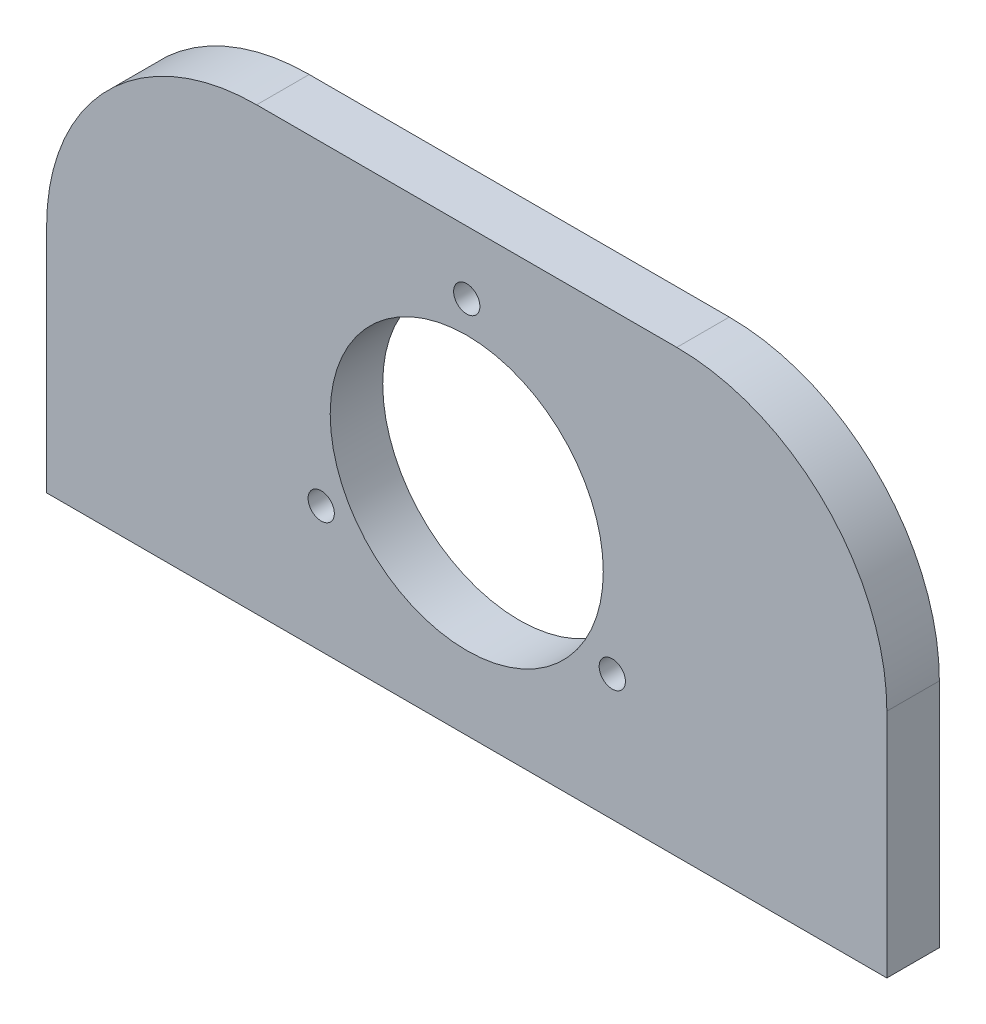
ISO-10303-21;
HEADER;
FILE_DESCRIPTION(('STEP AP214'),'2;1');
FILE_NAME('part.step','',(''),(''),'','','');
FILE_SCHEMA(('AUTOMOTIVE_DESIGN { 1 0 10303 214 1 1 1 1 }'));
ENDSEC;
DATA;
#1=APPLICATION_CONTEXT('core data for automotive mechanical design processes');
#2=APPLICATION_PROTOCOL_DEFINITION('international standard','automotive_design',2000,#1);
#3=PRODUCT_CONTEXT('',#1,'mechanical');
#4=PRODUCT('Part','Part','',(#3));
#5=PRODUCT_RELATED_PRODUCT_CATEGORY('part','',(#4));
#6=PRODUCT_DEFINITION_FORMATION('','',#4);
#7=PRODUCT_DEFINITION_CONTEXT('part definition',#1,'design');
#8=PRODUCT_DEFINITION('design','',#6,#7);
#9=PRODUCT_DEFINITION_SHAPE('','',#8);
#10=(LENGTH_UNIT() NAMED_UNIT(*) SI_UNIT(.MILLI.,.METRE.));
#11=(NAMED_UNIT(*) PLANE_ANGLE_UNIT() SI_UNIT($,.RADIAN.));
#12=(NAMED_UNIT(*) SI_UNIT($,.STERADIAN.) SOLID_ANGLE_UNIT());
#13=UNCERTAINTY_MEASURE_WITH_UNIT(LENGTH_MEASURE(1.E-05),#10,'distance_accuracy_value','');
#14=(GEOMETRIC_REPRESENTATION_CONTEXT(3) GLOBAL_UNCERTAINTY_ASSIGNED_CONTEXT((#13)) GLOBAL_UNIT_ASSIGNED_CONTEXT((#10,
#11,#12)) REPRESENTATION_CONTEXT('',''));
#15=CARTESIAN_POINT('',(0.,0.,0.));
#16=DIRECTION('',(0.,0.,1.));
#17=DIRECTION('',(1.,0.,0.));
#18=AXIS2_PLACEMENT_3D('',#15,#16,#17);
#19=CARTESIAN_POINT('',(0.,0.,2.5));
#20=DIRECTION('',(0.,0.,1.));
#21=DIRECTION('',(1.,0.,0.));
#22=AXIS2_PLACEMENT_3D('',#19,#20,#21);
#23=PLANE('',#22);
#24=CARTESIAN_POINT('',(13.856406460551,-7.99999999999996,2.5));
#25=DIRECTION('',(0.,0.,1.));
#26=DIRECTION('',(1.,0.,0.));
#27=AXIS2_PLACEMENT_3D('',#24,#25,#26);
#28=CIRCLE('',#27,1.25);
#29=CARTESIAN_POINT('',(15.106406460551,-7.99999999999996,2.5));
#30=VERTEX_POINT('',#29);
#31=EDGE_CURVE('E404',#30,#30,#28,.T.);
#32=ORIENTED_EDGE('',*,*,#31,.F.);
#33=EDGE_LOOP('',(#32));
#34=FACE_BOUND('',#33,.T.);
#35=CARTESIAN_POINT('',(0.,16.,2.5));
#36=DIRECTION('',(0.,0.,1.));
#37=DIRECTION('',(1.,0.,0.));
#38=AXIS2_PLACEMENT_3D('',#35,#36,#37);
#39=CIRCLE('',#38,1.25);
#40=CARTESIAN_POINT('',(1.25,16.,2.5));
#41=VERTEX_POINT('',#40);
#42=EDGE_CURVE('E406',#41,#41,#39,.T.);
#43=ORIENTED_EDGE('',*,*,#42,.F.);
#44=EDGE_LOOP('',(#43));
#45=FACE_BOUND('',#44,.T.);
#46=CARTESIAN_POINT('',(-13.856406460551,-7.99999999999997,2.5));
#47=DIRECTION('',(0.,0.,1.));
#48=DIRECTION('',(1.,0.,0.));
#49=AXIS2_PLACEMENT_3D('',#46,#47,#48);
#50=CIRCLE('',#49,1.25);
#51=CARTESIAN_POINT('',(-12.606406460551,-7.99999999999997,2.5));
#52=VERTEX_POINT('',#51);
#53=EDGE_CURVE('E414',#52,#52,#50,.T.);
#54=ORIENTED_EDGE('',*,*,#53,.F.);
#55=EDGE_LOOP('',(#54));
#56=FACE_BOUND('',#55,.T.);
#57=DIRECTION('',(0.,1.,0.));
#58=VECTOR('',#57,1.);
#59=CARTESIAN_POINT('',(40.,22.,2.5));
#60=LINE('',#59,#58);
#61=CARTESIAN_POINT('',(40.,-20.,2.5));
#62=VERTEX_POINT('',#61);
#63=CARTESIAN_POINT('',(40.,2.00000000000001,2.5));
#64=VERTEX_POINT('',#63);
#65=EDGE_CURVE('E152',#62,#64,#60,.T.);
#66=ORIENTED_EDGE('',*,*,#65,.T.);
#67=CARTESIAN_POINT('',(20.,2.00000000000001,2.5));
#68=DIRECTION('',(0.,0.,1.));
#69=DIRECTION('',(1.,0.,0.));
#70=AXIS2_PLACEMENT_3D('',#67,#68,#69);
#71=CIRCLE('',#70,20.);
#72=CARTESIAN_POINT('',(20.,22.,2.5));
#73=VERTEX_POINT('',#72);
#74=EDGE_CURVE('E47',#64,#73,#71,.T.);
#75=ORIENTED_EDGE('',*,*,#74,.T.);
#76=DIRECTION('',(-1.,0.,0.));
#77=VECTOR('',#76,1.);
#78=CARTESIAN_POINT('',(-40.,22.,2.5));
#79=LINE('',#78,#77);
#80=CARTESIAN_POINT('',(-20.,22.,2.5));
#81=VERTEX_POINT('',#80);
#82=EDGE_CURVE('E154',#73,#81,#79,.T.);
#83=ORIENTED_EDGE('',*,*,#82,.T.);
#84=CARTESIAN_POINT('',(-20.,2.,2.5));
#85=DIRECTION('',(0.,0.,1.));
#86=DIRECTION('',(1.,0.,0.));
#87=AXIS2_PLACEMENT_3D('',#84,#85,#86);
#88=CIRCLE('',#87,20.);
#89=CARTESIAN_POINT('',(-40.,1.99999999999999,2.5));
#90=VERTEX_POINT('',#89);
#91=EDGE_CURVE('E54',#81,#90,#88,.T.);
#92=ORIENTED_EDGE('',*,*,#91,.T.);
#93=DIRECTION('',(0.,-1.,0.));
#94=VECTOR('',#93,1.);
#95=CARTESIAN_POINT('',(-40.,22.,2.5));
#96=LINE('',#95,#94);
#97=CARTESIAN_POINT('',(-40.,-20.,2.5));
#98=VERTEX_POINT('',#97);
#99=EDGE_CURVE('E147',#90,#98,#96,.T.);
#100=ORIENTED_EDGE('',*,*,#99,.T.);
#101=DIRECTION('',(1.,0.,0.));
#102=VECTOR('',#101,1.);
#103=CARTESIAN_POINT('',(-40.,-20.,2.5));
#104=LINE('',#103,#102);
#105=EDGE_CURVE('E149',#98,#62,#104,.T.);
#106=ORIENTED_EDGE('',*,*,#105,.T.);
#107=EDGE_LOOP('',(#66,#75,#83,#92,#100,#106));
#108=FACE_BOUND('',#107,.T.);
#109=CARTESIAN_POINT('',(0.,0.,2.5));
#110=DIRECTION('',(0.,0.,1.));
#111=DIRECTION('',(1.,0.,0.));
#112=AXIS2_PLACEMENT_3D('',#109,#110,#111);
#113=CIRCLE('',#112,13.);
#114=CARTESIAN_POINT('',(13.,0.,2.5));
#115=VERTEX_POINT('',#114);
#116=EDGE_CURVE('E141',#115,#115,#113,.T.);
#117=ORIENTED_EDGE('',*,*,#116,.F.);
#118=EDGE_LOOP('',(#117));
#119=FACE_BOUND('',#118,.T.);
#120=ADVANCED_FACE('F39',(#34,#45,#56,#108,#119),#23,.T.);
#121=CARTESIAN_POINT('',(0.,0.,-2.5));
#122=DIRECTION('',(0.,0.,1.));
#123=DIRECTION('',(1.,0.,0.));
#124=AXIS2_PLACEMENT_3D('',#121,#122,#123);
#125=PLANE('',#124);
#126=CARTESIAN_POINT('',(13.856406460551,-7.99999999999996,-2.5));
#127=DIRECTION('',(0.,0.,1.));
#128=DIRECTION('',(1.,0.,0.));
#129=AXIS2_PLACEMENT_3D('',#126,#127,#128);
#130=CIRCLE('',#129,1.25);
#131=CARTESIAN_POINT('',(15.106406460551,-7.99999999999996,-2.5));
#132=VERTEX_POINT('',#131);
#133=EDGE_CURVE('E402',#132,#132,#130,.T.);
#134=ORIENTED_EDGE('',*,*,#133,.T.);
#135=EDGE_LOOP('',(#134));
#136=FACE_BOUND('',#135,.T.);
#137=CARTESIAN_POINT('',(0.,16.,-2.5));
#138=DIRECTION('',(0.,0.,1.));
#139=DIRECTION('',(1.,0.,0.));
#140=AXIS2_PLACEMENT_3D('',#137,#138,#139);
#141=CIRCLE('',#140,1.25);
#142=CARTESIAN_POINT('',(1.25,16.,-2.5));
#143=VERTEX_POINT('',#142);
#144=EDGE_CURVE('E411',#143,#143,#141,.T.);
#145=ORIENTED_EDGE('',*,*,#144,.T.);
#146=EDGE_LOOP('',(#145));
#147=FACE_BOUND('',#146,.T.);
#148=CARTESIAN_POINT('',(-13.856406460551,-7.99999999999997,-2.5));
#149=DIRECTION('',(0.,0.,1.));
#150=DIRECTION('',(1.,0.,0.));
#151=AXIS2_PLACEMENT_3D('',#148,#149,#150);
#152=CIRCLE('',#151,1.25);
#153=CARTESIAN_POINT('',(-12.606406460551,-7.99999999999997,-2.5));
#154=VERTEX_POINT('',#153);
#155=EDGE_CURVE('E122',#154,#154,#152,.T.);
#156=ORIENTED_EDGE('',*,*,#155,.T.);
#157=EDGE_LOOP('',(#156));
#158=FACE_BOUND('',#157,.T.);
#159=DIRECTION('',(-1.,0.,0.));
#160=VECTOR('',#159,1.);
#161=CARTESIAN_POINT('',(-40.,22.,-2.5));
#162=LINE('',#161,#160);
#163=CARTESIAN_POINT('',(20.,22.,-2.5));
#164=VERTEX_POINT('',#163);
#165=CARTESIAN_POINT('',(-20.,22.,-2.5));
#166=VERTEX_POINT('',#165);
#167=EDGE_CURVE('E150',#164,#166,#162,.T.);
#168=ORIENTED_EDGE('',*,*,#167,.F.);
#169=CARTESIAN_POINT('',(20.,2.00000000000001,-2.5));
#170=DIRECTION('',(0.,0.,1.));
#171=DIRECTION('',(1.,0.,0.));
#172=AXIS2_PLACEMENT_3D('',#169,#170,#171);
#173=CIRCLE('',#172,20.);
#174=CARTESIAN_POINT('',(40.,2.00000000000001,-2.5));
#175=VERTEX_POINT('',#174);
#176=EDGE_CURVE('E176',#164,#175,#173,.F.);
#177=ORIENTED_EDGE('',*,*,#176,.T.);
#178=DIRECTION('',(0.,1.,0.));
#179=VECTOR('',#178,1.);
#180=CARTESIAN_POINT('',(40.,22.,-2.5));
#181=LINE('',#180,#179);
#182=CARTESIAN_POINT('',(40.,-20.,-2.5));
#183=VERTEX_POINT('',#182);
#184=EDGE_CURVE('E160',#183,#175,#181,.T.);
#185=ORIENTED_EDGE('',*,*,#184,.F.);
#186=DIRECTION('',(1.,0.,0.));
#187=VECTOR('',#186,1.);
#188=CARTESIAN_POINT('',(-40.,-20.,-2.5));
#189=LINE('',#188,#187);
#190=CARTESIAN_POINT('',(-40.,-20.,-2.5));
#191=VERTEX_POINT('',#190);
#192=EDGE_CURVE('E158',#191,#183,#189,.T.);
#193=ORIENTED_EDGE('',*,*,#192,.F.);
#194=DIRECTION('',(0.,-1.,0.));
#195=VECTOR('',#194,1.);
#196=CARTESIAN_POINT('',(-40.,22.,-2.5));
#197=LINE('',#196,#195);
#198=CARTESIAN_POINT('',(-40.,1.99999999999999,-2.5));
#199=VERTEX_POINT('',#198);
#200=EDGE_CURVE('E144',#199,#191,#197,.T.);
#201=ORIENTED_EDGE('',*,*,#200,.F.);
#202=CARTESIAN_POINT('',(-20.,2.,-2.5));
#203=DIRECTION('',(0.,0.,1.));
#204=DIRECTION('',(1.,0.,0.));
#205=AXIS2_PLACEMENT_3D('',#202,#203,#204);
#206=CIRCLE('',#205,20.);
#207=EDGE_CURVE('E174',#199,#166,#206,.F.);
#208=ORIENTED_EDGE('',*,*,#207,.T.);
#209=EDGE_LOOP('',(#168,#177,#185,#193,#201,#208));
#210=FACE_BOUND('',#209,.T.);
#211=CARTESIAN_POINT('',(0.,0.,-2.5));
#212=DIRECTION('',(0.,0.,1.));
#213=DIRECTION('',(1.,0.,0.));
#214=AXIS2_PLACEMENT_3D('',#211,#212,#213);
#215=CIRCLE('',#214,13.);
#216=CARTESIAN_POINT('',(13.,0.,-2.5));
#217=VERTEX_POINT('',#216);
#218=EDGE_CURVE('E140',#217,#217,#215,.T.);
#219=ORIENTED_EDGE('',*,*,#218,.T.);
#220=EDGE_LOOP('',(#219));
#221=FACE_BOUND('',#220,.T.);
#222=ADVANCED_FACE('F191',(#136,#147,#158,#210,#221),#125,.F.);
#223=CARTESIAN_POINT('',(-40.,22.,2.5));
#224=DIRECTION('',(1.,0.,0.));
#225=DIRECTION('',(0.,1.,0.));
#226=AXIS2_PLACEMENT_3D('',#223,#224,#225);
#227=PLANE('',#226);
#228=ORIENTED_EDGE('',*,*,#99,.F.);
#229=DIRECTION('',(0.,0.,-1.));
#230=VECTOR('',#229,1.);
#231=CARTESIAN_POINT('',(-40.,1.99999999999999,2.5));
#232=LINE('',#231,#230);
#233=EDGE_CURVE('E11',#90,#199,#232,.T.);
#234=ORIENTED_EDGE('',*,*,#233,.T.);
#235=ORIENTED_EDGE('',*,*,#200,.T.);
#236=DIRECTION('',(0.,0.,-1.));
#237=VECTOR('',#236,1.);
#238=CARTESIAN_POINT('',(-40.,-20.,2.5));
#239=LINE('',#238,#237);
#240=EDGE_CURVE('E166',#98,#191,#239,.T.);
#241=ORIENTED_EDGE('',*,*,#240,.F.);
#242=EDGE_LOOP('',(#228,#234,#235,#241));
#243=FACE_BOUND('',#242,.T.);
#244=ADVANCED_FACE('F202',(#243),#227,.F.);
#245=CARTESIAN_POINT('',(-40.,-20.,2.5));
#246=DIRECTION('',(0.,1.,0.));
#247=DIRECTION('',(-1.,0.,0.));
#248=AXIS2_PLACEMENT_3D('',#245,#246,#247);
#249=PLANE('',#248);
#250=CARTESIAN_POINT('',(33.5,-20.,0.));
#251=DIRECTION('',(0.,-1.,0.));
#252=DIRECTION('',(0.,0.,-1.));
#253=AXIS2_PLACEMENT_3D('',#250,#251,#252);
#254=CIRCLE('',#253,1.64999999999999);
#255=CARTESIAN_POINT('',(33.5,-20.,-1.64999999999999));
#256=VERTEX_POINT('',#255);
#257=EDGE_CURVE('E116',#256,#256,#254,.T.);
#258=ORIENTED_EDGE('',*,*,#257,.F.);
#259=EDGE_LOOP('',(#258));
#260=FACE_BOUND('',#259,.T.);
#261=CARTESIAN_POINT('',(-33.5,-20.,0.));
#262=DIRECTION('',(0.,-1.,0.));
#263=DIRECTION('',(0.,0.,-1.));
#264=AXIS2_PLACEMENT_3D('',#261,#262,#263);
#265=CIRCLE('',#264,1.64999999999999);
#266=CARTESIAN_POINT('',(-33.5,-20.,-1.64999999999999));
#267=VERTEX_POINT('',#266);
#268=EDGE_CURVE('E115',#267,#267,#265,.T.);
#269=ORIENTED_EDGE('',*,*,#268,.F.);
#270=EDGE_LOOP('',(#269));
#271=FACE_BOUND('',#270,.T.);
#272=CARTESIAN_POINT('',(20.,-20.,0.));
#273=DIRECTION('',(0.,-1.,0.));
#274=DIRECTION('',(0.,0.,-1.));
#275=AXIS2_PLACEMENT_3D('',#272,#273,#274);
#276=CIRCLE('',#275,1.99999999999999);
#277=CARTESIAN_POINT('',(20.,-20.,-1.99999999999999));
#278=VERTEX_POINT('',#277);
#279=EDGE_CURVE('E128',#278,#278,#276,.T.);
#280=ORIENTED_EDGE('',*,*,#279,.F.);
#281=EDGE_LOOP('',(#280));
#282=FACE_BOUND('',#281,.T.);
#283=CARTESIAN_POINT('',(-20.,-20.,0.));
#284=DIRECTION('',(0.,-1.,0.));
#285=DIRECTION('',(0.,0.,-1.));
#286=AXIS2_PLACEMENT_3D('',#283,#284,#285);
#287=CIRCLE('',#286,1.99999999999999);
#288=CARTESIAN_POINT('',(-20.,-20.,-1.99999999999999));
#289=VERTEX_POINT('',#288);
#290=EDGE_CURVE('E134',#289,#289,#287,.T.);
#291=ORIENTED_EDGE('',*,*,#290,.F.);
#292=EDGE_LOOP('',(#291));
#293=FACE_BOUND('',#292,.T.);
#294=ORIENTED_EDGE('',*,*,#192,.T.);
#295=DIRECTION('',(0.,0.,-1.));
#296=VECTOR('',#295,1.);
#297=CARTESIAN_POINT('',(40.,-20.,2.5));
#298=LINE('',#297,#296);
#299=EDGE_CURVE('E156',#62,#183,#298,.T.);
#300=ORIENTED_EDGE('',*,*,#299,.F.);
#301=ORIENTED_EDGE('',*,*,#105,.F.);
#302=ORIENTED_EDGE('',*,*,#240,.T.);
#303=EDGE_LOOP('',(#294,#300,#301,#302));
#304=FACE_BOUND('',#303,.T.);
#305=ADVANCED_FACE('F198',(#260,#271,#282,#293,#304),#249,.F.);
#306=CARTESIAN_POINT('',(40.,22.,2.5));
#307=DIRECTION('',(-1.,0.,0.));
#308=DIRECTION('',(0.,0.,1.));
#309=AXIS2_PLACEMENT_3D('',#306,#307,#308);
#310=PLANE('',#309);
#311=ORIENTED_EDGE('',*,*,#184,.T.);
#312=DIRECTION('',(0.,0.,-1.));
#313=VECTOR('',#312,1.);
#314=CARTESIAN_POINT('',(40.,2.00000000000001,2.5));
#315=LINE('',#314,#313);
#316=EDGE_CURVE('E62',#175,#64,#315,.F.);
#317=ORIENTED_EDGE('',*,*,#316,.T.);
#318=ORIENTED_EDGE('',*,*,#65,.F.);
#319=ORIENTED_EDGE('',*,*,#299,.T.);
#320=EDGE_LOOP('',(#311,#317,#318,#319));
#321=FACE_BOUND('',#320,.T.);
#322=ADVANCED_FACE('F194',(#321),#310,.F.);
#323=CARTESIAN_POINT('',(-40.,22.,2.5));
#324=DIRECTION('',(0.,-1.,0.));
#325=DIRECTION('',(1.,0.,0.));
#326=AXIS2_PLACEMENT_3D('',#323,#324,#325);
#327=PLANE('',#326);
#328=ORIENTED_EDGE('',*,*,#82,.F.);
#329=DIRECTION('',(0.,0.,-1.));
#330=VECTOR('',#329,1.);
#331=CARTESIAN_POINT('',(20.,22.,2.5));
#332=LINE('',#331,#330);
#333=EDGE_CURVE('E171',#73,#164,#332,.T.);
#334=ORIENTED_EDGE('',*,*,#333,.T.);
#335=ORIENTED_EDGE('',*,*,#167,.T.);
#336=DIRECTION('',(0.,0.,-1.));
#337=VECTOR('',#336,1.);
#338=CARTESIAN_POINT('',(-20.,22.,2.5));
#339=LINE('',#338,#337);
#340=EDGE_CURVE('E169',#166,#81,#339,.F.);
#341=ORIENTED_EDGE('',*,*,#340,.T.);
#342=EDGE_LOOP('',(#328,#334,#335,#341));
#343=FACE_BOUND('',#342,.T.);
#344=ADVANCED_FACE('F185',(#343),#327,.F.);
#345=CARTESIAN_POINT('',(0.,0.,2.5));
#346=DIRECTION('',(0.,0.,-1.));
#347=DIRECTION('',(-1.,0.,0.));
#348=AXIS2_PLACEMENT_3D('',#345,#346,#347);
#349=CYLINDRICAL_SURFACE('',#348,13.);
#350=ORIENTED_EDGE('',*,*,#116,.T.);
#351=EDGE_LOOP('',(#350));
#352=FACE_BOUND('',#351,.T.);
#353=ORIENTED_EDGE('',*,*,#218,.F.);
#354=EDGE_LOOP('',(#353));
#355=FACE_BOUND('',#354,.T.);
#356=ADVANCED_FACE('F214',(#352,#355),#349,.F.);
#357=CARTESIAN_POINT('',(20.,2.00000000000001,2.5));
#358=DIRECTION('',(0.,0.,-1.));
#359=DIRECTION('',(-1.,0.,0.));
#360=AXIS2_PLACEMENT_3D('',#357,#358,#359);
#361=CYLINDRICAL_SURFACE('',#360,20.);
#362=ORIENTED_EDGE('',*,*,#74,.F.);
#363=ORIENTED_EDGE('',*,*,#316,.F.);
#364=ORIENTED_EDGE('',*,*,#176,.F.);
#365=ORIENTED_EDGE('',*,*,#333,.F.);
#366=EDGE_LOOP('',(#362,#363,#364,#365));
#367=FACE_BOUND('',#366,.T.);
#368=ADVANCED_FACE('F188',(#367),#361,.T.);
#369=CARTESIAN_POINT('',(-20.,2.,2.5));
#370=DIRECTION('',(0.,0.,-1.));
#371=DIRECTION('',(-1.,0.,0.));
#372=AXIS2_PLACEMENT_3D('',#369,#370,#371);
#373=CYLINDRICAL_SURFACE('',#372,20.);
#374=ORIENTED_EDGE('',*,*,#91,.F.);
#375=ORIENTED_EDGE('',*,*,#340,.F.);
#376=ORIENTED_EDGE('',*,*,#207,.F.);
#377=ORIENTED_EDGE('',*,*,#233,.F.);
#378=EDGE_LOOP('',(#374,#375,#376,#377));
#379=FACE_BOUND('',#378,.T.);
#380=ADVANCED_FACE('F41',(#379),#373,.T.);
#381=CARTESIAN_POINT('',(-20.,-16.,0.));
#382=DIRECTION('',(0.,-1.,0.));
#383=DIRECTION('',(0.,0.,-1.));
#384=AXIS2_PLACEMENT_3D('',#381,#382,#383);
#385=CONICAL_SURFACE('',#384,2.,1.02974425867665);
#386=CARTESIAN_POINT('',(-20.,-14.7982787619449,0.));
#387=VERTEX_POINT('',#386);
#388=VERTEX_LOOP('',#387);
#389=FACE_BOUND('',#388,.T.);
#390=CARTESIAN_POINT('',(-20.,-16.,0.));
#391=DIRECTION('',(0.,-1.,0.));
#392=DIRECTION('',(0.,0.,-1.));
#393=AXIS2_PLACEMENT_3D('',#390,#391,#392);
#394=CIRCLE('',#393,2.);
#395=CARTESIAN_POINT('',(-20.,-16.,-2.));
#396=VERTEX_POINT('',#395);
#397=EDGE_CURVE('E137',#396,#396,#394,.T.);
#398=ORIENTED_EDGE('',*,*,#397,.T.);
#399=EDGE_LOOP('',(#398));
#400=FACE_BOUND('',#399,.T.);
#401=ADVANCED_FACE('F206',(#389,#400),#385,.F.);
#402=CARTESIAN_POINT('',(-20.,-20.,0.));
#403=DIRECTION('',(0.,-1.,0.));
#404=DIRECTION('',(0.,0.,-1.));
#405=AXIS2_PLACEMENT_3D('',#402,#403,#404);
#406=CYLINDRICAL_SURFACE('',#405,1.99999999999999);
#407=ORIENTED_EDGE('',*,*,#397,.F.);
#408=EDGE_LOOP('',(#407));
#409=FACE_BOUND('',#408,.T.);
#410=ORIENTED_EDGE('',*,*,#290,.T.);
#411=EDGE_LOOP('',(#410));
#412=FACE_BOUND('',#411,.T.);
#413=ADVANCED_FACE('F211',(#409,#412),#406,.F.);
#414=CARTESIAN_POINT('',(20.,-16.,0.));
#415=DIRECTION('',(0.,-1.,0.));
#416=DIRECTION('',(0.,0.,-1.));
#417=AXIS2_PLACEMENT_3D('',#414,#415,#416);
#418=CONICAL_SURFACE('',#417,2.,1.02974425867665);
#419=CARTESIAN_POINT('',(20.,-14.7982787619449,0.));
#420=VERTEX_POINT('',#419);
#421=VERTEX_LOOP('',#420);
#422=FACE_BOUND('',#421,.T.);
#423=CARTESIAN_POINT('',(20.,-16.,0.));
#424=DIRECTION('',(0.,-1.,0.));
#425=DIRECTION('',(0.,0.,-1.));
#426=AXIS2_PLACEMENT_3D('',#423,#424,#425);
#427=CIRCLE('',#426,2.);
#428=CARTESIAN_POINT('',(20.,-16.,-2.));
#429=VERTEX_POINT('',#428);
#430=EDGE_CURVE('E131',#429,#429,#427,.T.);
#431=ORIENTED_EDGE('',*,*,#430,.T.);
#432=EDGE_LOOP('',(#431));
#433=FACE_BOUND('',#432,.T.);
#434=ADVANCED_FACE('F282',(#422,#433),#418,.F.);
#435=CARTESIAN_POINT('',(20.,-20.,0.));
#436=DIRECTION('',(0.,-1.,0.));
#437=DIRECTION('',(0.,0.,-1.));
#438=AXIS2_PLACEMENT_3D('',#435,#436,#437);
#439=CYLINDRICAL_SURFACE('',#438,1.99999999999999);
#440=ORIENTED_EDGE('',*,*,#430,.F.);
#441=EDGE_LOOP('',(#440));
#442=FACE_BOUND('',#441,.T.);
#443=ORIENTED_EDGE('',*,*,#279,.T.);
#444=EDGE_LOOP('',(#443));
#445=FACE_BOUND('',#444,.T.);
#446=ADVANCED_FACE('F291',(#442,#445),#439,.F.);
#447=CARTESIAN_POINT('',(-33.5,-8.5,0.));
#448=DIRECTION('',(0.,-1.,0.));
#449=DIRECTION('',(0.,0.,-1.));
#450=AXIS2_PLACEMENT_3D('',#447,#448,#449);
#451=CONICAL_SURFACE('',#450,1.64999999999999,1.02974425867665);
#452=CARTESIAN_POINT('',(-33.5,-7.50857997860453,0.));
#453=VERTEX_POINT('',#452);
#454=VERTEX_LOOP('',#453);
#455=FACE_BOUND('',#454,.T.);
#456=CARTESIAN_POINT('',(-33.5,-8.5,0.));
#457=DIRECTION('',(0.,-1.,0.));
#458=DIRECTION('',(0.,0.,-1.));
#459=AXIS2_PLACEMENT_3D('',#456,#457,#458);
#460=CIRCLE('',#459,1.64999999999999);
#461=CARTESIAN_POINT('',(-33.5,-8.5,-1.64999999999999));
#462=VERTEX_POINT('',#461);
#463=EDGE_CURVE('E119',#462,#462,#460,.T.);
#464=ORIENTED_EDGE('',*,*,#463,.T.);
#465=EDGE_LOOP('',(#464));
#466=FACE_BOUND('',#465,.T.);
#467=ADVANCED_FACE('F300',(#455,#466),#451,.F.);
#468=CARTESIAN_POINT('',(-33.5,-20.,0.));
#469=DIRECTION('',(0.,-1.,0.));
#470=DIRECTION('',(0.,0.,-1.));
#471=AXIS2_PLACEMENT_3D('',#468,#469,#470);
#472=CYLINDRICAL_SURFACE('',#471,1.64999999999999);
#473=ORIENTED_EDGE('',*,*,#463,.F.);
#474=EDGE_LOOP('',(#473));
#475=FACE_BOUND('',#474,.T.);
#476=ORIENTED_EDGE('',*,*,#268,.T.);
#477=EDGE_LOOP('',(#476));
#478=FACE_BOUND('',#477,.T.);
#479=ADVANCED_FACE('F109',(#475,#478),#472,.F.);
#480=CARTESIAN_POINT('',(33.5,-8.5,0.));
#481=DIRECTION('',(0.,-1.,0.));
#482=DIRECTION('',(0.,0.,-1.));
#483=AXIS2_PLACEMENT_3D('',#480,#481,#482);
#484=CONICAL_SURFACE('',#483,1.64999999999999,1.02974425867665);
#485=CARTESIAN_POINT('',(33.5,-7.50857997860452,0.));
#486=VERTEX_POINT('',#485);
#487=VERTEX_LOOP('',#486);
#488=FACE_BOUND('',#487,.T.);
#489=CARTESIAN_POINT('',(33.5,-8.5,0.));
#490=DIRECTION('',(0.,-1.,0.));
#491=DIRECTION('',(0.,0.,-1.));
#492=AXIS2_PLACEMENT_3D('',#489,#490,#491);
#493=CIRCLE('',#492,1.64999999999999);
#494=CARTESIAN_POINT('',(33.5,-8.5,-1.64999999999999));
#495=VERTEX_POINT('',#494);
#496=EDGE_CURVE('E113',#495,#495,#493,.T.);
#497=ORIENTED_EDGE('',*,*,#496,.T.);
#498=EDGE_LOOP('',(#497));
#499=FACE_BOUND('',#498,.T.);
#500=ADVANCED_FACE('F105',(#488,#499),#484,.F.);
#501=CARTESIAN_POINT('',(33.5,-20.,0.));
#502=DIRECTION('',(0.,-1.,0.));
#503=DIRECTION('',(0.,0.,-1.));
#504=AXIS2_PLACEMENT_3D('',#501,#502,#503);
#505=CYLINDRICAL_SURFACE('',#504,1.64999999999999);
#506=ORIENTED_EDGE('',*,*,#496,.F.);
#507=EDGE_LOOP('',(#506));
#508=FACE_BOUND('',#507,.T.);
#509=ORIENTED_EDGE('',*,*,#257,.T.);
#510=EDGE_LOOP('',(#509));
#511=FACE_BOUND('',#510,.T.);
#512=ADVANCED_FACE('F108',(#508,#511),#505,.F.);
#513=CARTESIAN_POINT('',(-13.856406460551,-7.99999999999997,2.5));
#514=DIRECTION('',(0.,0.,1.));
#515=DIRECTION('',(1.,0.,0.));
#516=AXIS2_PLACEMENT_3D('',#513,#514,#515);
#517=CYLINDRICAL_SURFACE('',#516,1.25);
#518=ORIENTED_EDGE('',*,*,#155,.F.);
#519=EDGE_LOOP('',(#518));
#520=FACE_BOUND('',#519,.T.);
#521=ORIENTED_EDGE('',*,*,#53,.T.);
#522=EDGE_LOOP('',(#521));
#523=FACE_BOUND('',#522,.T.);
#524=ADVANCED_FACE('F329',(#520,#523),#517,.F.);
#525=CARTESIAN_POINT('',(0.,16.,2.5));
#526=DIRECTION('',(0.,0.,1.));
#527=DIRECTION('',(1.,0.,0.));
#528=AXIS2_PLACEMENT_3D('',#525,#526,#527);
#529=CYLINDRICAL_SURFACE('',#528,1.25);
#530=ORIENTED_EDGE('',*,*,#144,.F.);
#531=EDGE_LOOP('',(#530));
#532=FACE_BOUND('',#531,.T.);
#533=ORIENTED_EDGE('',*,*,#42,.T.);
#534=EDGE_LOOP('',(#533));
#535=FACE_BOUND('',#534,.T.);
#536=ADVANCED_FACE('F336',(#532,#535),#529,.F.);
#537=CARTESIAN_POINT('',(13.856406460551,-7.99999999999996,2.5));
#538=DIRECTION('',(0.,0.,1.));
#539=DIRECTION('',(1.,0.,0.));
#540=AXIS2_PLACEMENT_3D('',#537,#538,#539);
#541=CYLINDRICAL_SURFACE('',#540,1.25);
#542=ORIENTED_EDGE('',*,*,#133,.F.);
#543=EDGE_LOOP('',(#542));
#544=FACE_BOUND('',#543,.T.);
#545=ORIENTED_EDGE('',*,*,#31,.T.);
#546=EDGE_LOOP('',(#545));
#547=FACE_BOUND('',#546,.T.);
#548=ADVANCED_FACE('F344',(#544,#547),#541,.F.);
#549=CLOSED_SHELL('',(#120,#222,#244,#305,#322,#344,#356,#368,#380,#401,#413,#434,#446,#467,
#479,#500,#512,#524,#536,#548));
#550=MANIFOLD_SOLID_BREP('B2',#549);
#551=ADVANCED_BREP_SHAPE_REPRESENTATION('',(#18,#550),#14);
#552=SHAPE_DEFINITION_REPRESENTATION(#9,#551);
ENDSEC;
END-ISO-10303-21;
